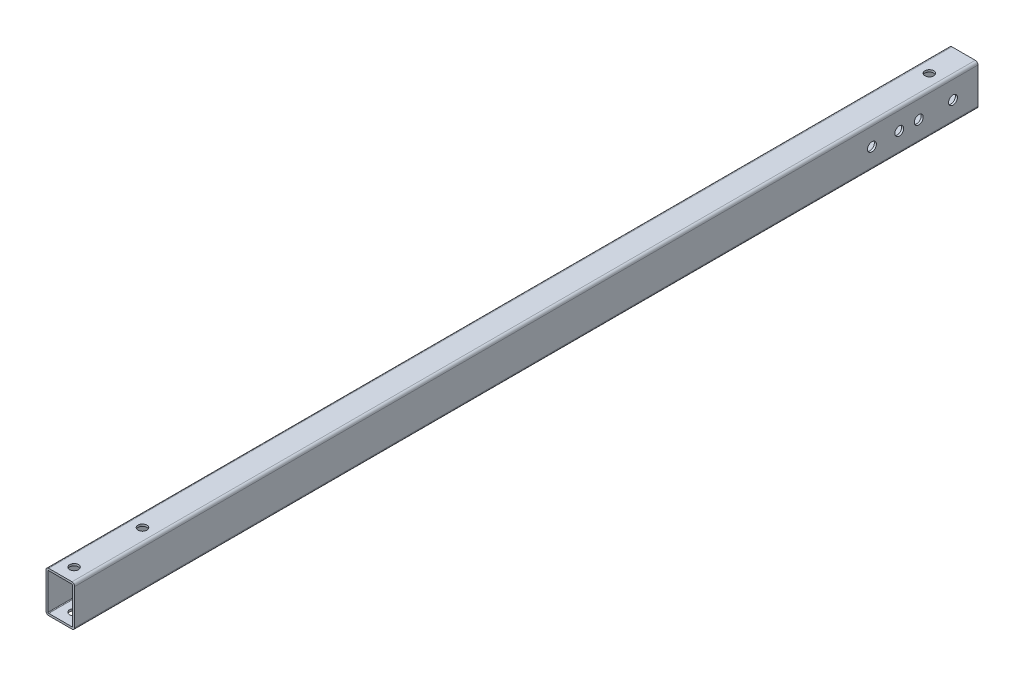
from build123d import *

# Parameters (mm, degrees)
BASE_EXTRUSION_DEPTH    = 660
ESQUISSE2_R             = 3.25
ENL_V_MAT_EXTRU_1_DEPTH = 47.5
ESQUISSE4_R             = 3.25
ENL_V_MAT_EXTRU_2_DEPTH = 668.691732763
ESQUISSE6_R             = 3.25
ENL_V_MAT_EXTRU_3_DEPTH = 668.691732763


with BuildPart() as part:
    # Esquisse1 → Base-Extrusion (new body)
    with BuildSketch(Plane.XY):
        with BuildLine():
            Line((-77.5, -15), (-94.5, -15))
            ThreePointArc((-94.5, -15), (-95.914213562, -14.414213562), (-96.5, -13))
            Line((-96.5, -13), (-96.5, 13))
            ThreePointArc((-96.5, 13), (-95.914213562, 14.414213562), (-94.5, 15))
            Line((-94.5, 15), (-77.5, 15))
            ThreePointArc((-77.5, 15), (-76.085786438, 14.414213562), (-75.5, 13))
            Line((-75.5, 13), (-75.5, -13))
            ThreePointArc((-75.5, -13), (-76.085786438, -14.414213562), (-77.5, -15))
        make_face()
        with BuildLine():
            Line((-77, -13), (-77, 13))
            ThreePointArc((-77, 13), (-77.146446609, 13.353553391), (-77.5, 13.5))
            Line((-77.5, 13.5), (-94.5, 13.5))
            ThreePointArc((-94.5, 13.5), (-94.853553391, 13.353553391), (-95, 13))
            Line((-95, 13), (-95, -13))
            ThreePointArc((-95, -13), (-94.853553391, -13.353553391), (-94.5, -13.5))
            Line((-94.5, -13.5), (-77.5, -13.5))
            ThreePointArc((-77.5, -13.5), (-77.146446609, -13.353553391), (-77, -13))
        make_face(mode=Mode.SUBTRACT)
    extrude(amount=-BASE_EXTRUSION_DEPTH)

    # Esquisse2 → Enl_v. mat.-Extru.1 (cut)
    with BuildSketch(Plane(origin=(-75.5, 0, 0), x_dir=(0, 0, -1), z_dir=(1, 0, 0))):
        with Locations(Location((641.710580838, 0, 0), (0, 0, 90))):
            Circle(ESQUISSE2_R)
        with Locations(Location((616.710580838, 0, 0), (0, 0, 90))):
            Circle(ESQUISSE2_R)
        with Locations(Location((602.5, 0, 0), (0, 0, 90))):
            Circle(ESQUISSE2_R)
        with Locations(Location((582.5, 0, 0), (0, 0, 90))):
            Circle(ESQUISSE2_R)
    extrude(amount=-ENL_V_MAT_EXTRU_1_DEPTH, mode=Mode.SUBTRACT)

    # Esquisse4 → Enl_v. mat.-Extru.2 (cut, through all)
    with BuildSketch(Plane(origin=(0, 15, 0), x_dir=(-1, 0, 0), z_dir=(0, 1, 0))):
        with Locations(Location((86, -10, 0), (0, 0, 90))):
            Circle(ESQUISSE4_R)
        with Locations(Location((86, -60, 0), (0, 0, 90))):
            Circle(ESQUISSE4_R)
    extrude(amount=-ENL_V_MAT_EXTRU_2_DEPTH, mode=Mode.SUBTRACT)

    # Esquisse6 → Enl_v. mat.-Extru.3 (cut, through all)
    with BuildSketch(Plane(origin=(0, 15, 0), x_dir=(-1, 0, 0), z_dir=(0, 1, 0))):
        with Locations(Location((86, -635, 0), (0, 0, 90))):
            Circle(ESQUISSE6_R)
    extrude(amount=-ENL_V_MAT_EXTRU_3_DEPTH, mode=Mode.SUBTRACT)


solid = part.part
